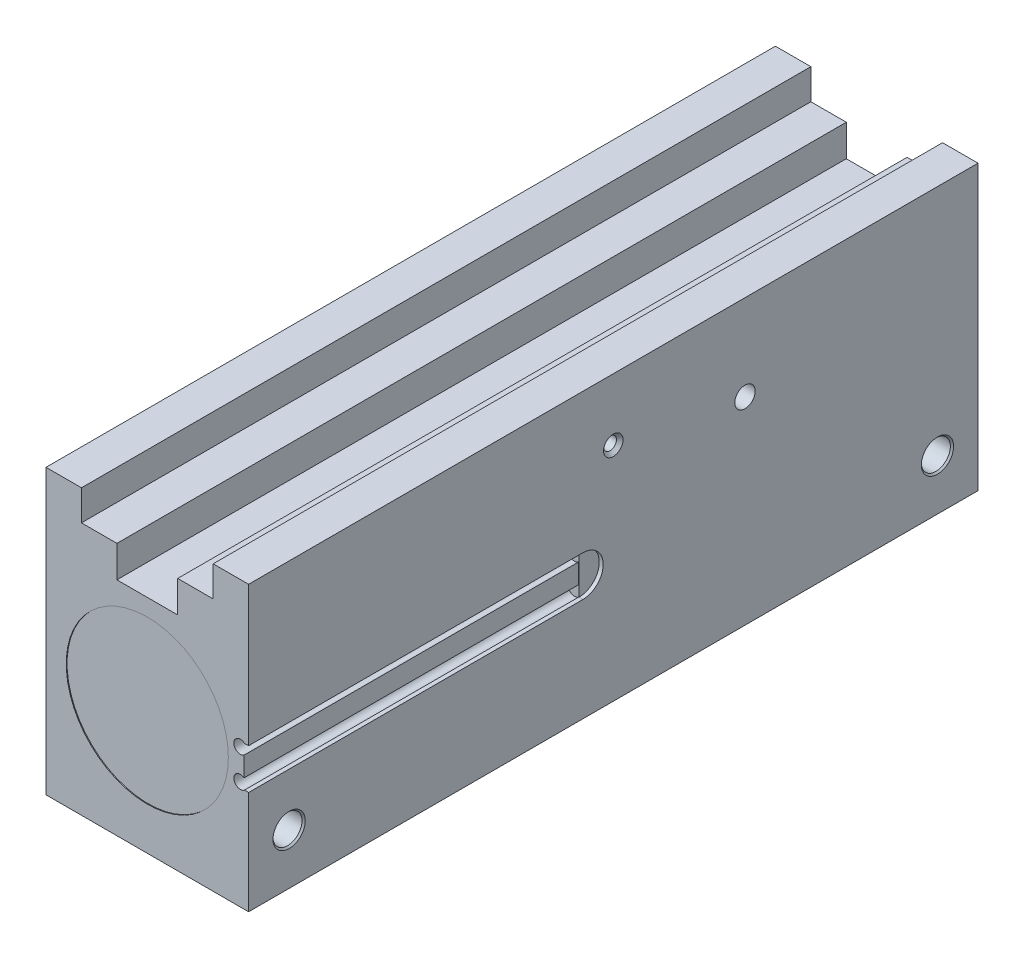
ISO-10303-21;
HEADER;
FILE_DESCRIPTION(('STEP AP214'),'2;1');
FILE_NAME('part.step','',(''),(''),'','','');
FILE_SCHEMA(('AUTOMOTIVE_DESIGN { 1 0 10303 214 1 1 1 1 }'));
ENDSEC;
DATA;
#1=APPLICATION_CONTEXT('core data for automotive mechanical design processes');
#2=APPLICATION_PROTOCOL_DEFINITION('international standard','automotive_design',2000,#1);
#3=PRODUCT_CONTEXT('',#1,'mechanical');
#4=PRODUCT('Part','Part','',(#3));
#5=PRODUCT_RELATED_PRODUCT_CATEGORY('part','',(#4));
#6=PRODUCT_DEFINITION_FORMATION('','',#4);
#7=PRODUCT_DEFINITION_CONTEXT('part definition',#1,'design');
#8=PRODUCT_DEFINITION('design','',#6,#7);
#9=PRODUCT_DEFINITION_SHAPE('','',#8);
#10=(LENGTH_UNIT() NAMED_UNIT(*) SI_UNIT(.MILLI.,.METRE.));
#11=(NAMED_UNIT(*) PLANE_ANGLE_UNIT() SI_UNIT($,.RADIAN.));
#12=(NAMED_UNIT(*) SI_UNIT($,.STERADIAN.) SOLID_ANGLE_UNIT());
#13=UNCERTAINTY_MEASURE_WITH_UNIT(LENGTH_MEASURE(1.E-05),#10,'distance_accuracy_value','');
#14=(GEOMETRIC_REPRESENTATION_CONTEXT(3) GLOBAL_UNCERTAINTY_ASSIGNED_CONTEXT((#13)) GLOBAL_UNIT_ASSIGNED_CONTEXT((#10,
#11,#12)) REPRESENTATION_CONTEXT('',''));
#15=CARTESIAN_POINT('',(0.,0.,0.));
#16=DIRECTION('',(0.,0.,1.));
#17=DIRECTION('',(1.,0.,0.));
#18=AXIS2_PLACEMENT_3D('',#15,#16,#17);
#19=CARTESIAN_POINT('',(60.9092,33.9725,-104.775));
#20=DIRECTION('',(0.,0.,1.));
#21=DIRECTION('',(1.,0.,0.));
#22=AXIS2_PLACEMENT_3D('',#19,#20,#21);
#23=PLANE('',#22);
#24=DIRECTION('',(1.,0.,0.));
#25=VECTOR('',#24,1.);
#26=CARTESIAN_POINT('',(62.1978589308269,32.385,-104.775));
#27=LINE('',#26,#25);
#28=CARTESIAN_POINT('',(62.1978589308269,32.385,-104.775));
#29=VERTEX_POINT('',#28);
#30=CARTESIAN_POINT('',(62.2681,32.385,-104.775));
#31=VERTEX_POINT('',#30);
#32=EDGE_CURVE('E266',#29,#31,#27,.T.);
#33=ORIENTED_EDGE('',*,*,#32,.T.);
#34=DIRECTION('',(0.,1.,0.));
#35=VECTOR('',#34,1.);
#36=CARTESIAN_POINT('',(62.2681,33.9725,-104.775));
#37=LINE('',#36,#35);
#38=CARTESIAN_POINT('',(62.2681,45.085,-104.775));
#39=VERTEX_POINT('',#38);
#40=EDGE_CURVE('E11',#31,#39,#37,.T.);
#41=ORIENTED_EDGE('',*,*,#40,.T.);
#42=DIRECTION('',(-1.,0.,0.));
#43=VECTOR('',#42,1.);
#44=CARTESIAN_POINT('',(62.1978589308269,45.085,-104.775));
#45=LINE('',#44,#43);
#46=CARTESIAN_POINT('',(62.1978589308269,45.085,-104.775));
#47=VERTEX_POINT('',#46);
#48=EDGE_CURVE('E269',#39,#47,#45,.T.);
#49=ORIENTED_EDGE('',*,*,#48,.T.);
#50=CARTESIAN_POINT('',(60.9092,43.4975,-104.775));
#51=DIRECTION('',(0.,0.,1.));
#52=DIRECTION('',(1.,0.,0.));
#53=AXIS2_PLACEMENT_3D('',#50,#51,#52);
#54=CIRCLE('',#53,2.0447);
#55=CARTESIAN_POINT('',(62.0776,41.8195132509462,-104.775));
#56=VERTEX_POINT('',#55);
#57=EDGE_CURVE('E272',#47,#56,#54,.T.);
#58=ORIENTED_EDGE('',*,*,#57,.T.);
#59=DIRECTION('',(0.,-1.,0.));
#60=VECTOR('',#59,1.);
#61=CARTESIAN_POINT('',(62.0776,41.8195132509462,-104.775));
#62=LINE('',#61,#60);
#63=CARTESIAN_POINT('',(62.0776,35.6504867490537,-104.775));
#64=VERTEX_POINT('',#63);
#65=EDGE_CURVE('E275',#56,#64,#62,.T.);
#66=ORIENTED_EDGE('',*,*,#65,.T.);
#67=CARTESIAN_POINT('',(60.9092,33.9725,-104.775));
#68=DIRECTION('',(0.,0.,1.));
#69=DIRECTION('',(1.,0.,0.));
#70=AXIS2_PLACEMENT_3D('',#67,#68,#69);
#71=CIRCLE('',#70,2.0447);
#72=EDGE_CURVE('E261',#64,#29,#71,.T.);
#73=ORIENTED_EDGE('',*,*,#72,.T.);
#74=EDGE_LOOP('',(#33,#41,#49,#58,#66,#73));
#75=FACE_BOUND('',#74,.T.);
#76=ADVANCED_FACE('F37',(#75),#23,.T.);
#77=CARTESIAN_POINT('',(0.,88.9,-228.6));
#78=DIRECTION('',(0.,1.,0.));
#79=DIRECTION('',(0.,0.,1.));
#80=AXIS2_PLACEMENT_3D('',#77,#78,#79);
#81=PLANE('',#80);
#82=DIRECTION('',(0.,0.,1.));
#83=VECTOR('',#82,1.);
#84=CARTESIAN_POINT('',(11.1125,88.9,-228.6));
#85=LINE('',#84,#83);
#86=CARTESIAN_POINT('',(11.1125,88.9,-228.6));
#87=VERTEX_POINT('',#86);
#88=CARTESIAN_POINT('',(11.1125,88.9,0.));
#89=VERTEX_POINT('',#88);
#90=EDGE_CURVE('E403',#87,#89,#85,.T.);
#91=ORIENTED_EDGE('',*,*,#90,.F.);
#92=DIRECTION('',(-1.,0.,0.));
#93=VECTOR('',#92,1.);
#94=CARTESIAN_POINT('',(0.,88.9,-228.6));
#95=LINE('',#94,#93);
#96=CARTESIAN_POINT('',(0.,88.9,-228.6));
#97=VERTEX_POINT('',#96);
#98=EDGE_CURVE('E431',#87,#97,#95,.T.);
#99=ORIENTED_EDGE('',*,*,#98,.T.);
#100=DIRECTION('',(0.,0.,1.));
#101=VECTOR('',#100,1.);
#102=CARTESIAN_POINT('',(0.,88.9,-228.6));
#103=LINE('',#102,#101);
#104=CARTESIAN_POINT('',(0.,88.9,0.));
#105=VERTEX_POINT('',#104);
#106=EDGE_CURVE('E45',#97,#105,#103,.T.);
#107=ORIENTED_EDGE('',*,*,#106,.T.);
#108=DIRECTION('',(-1.,0.,0.));
#109=VECTOR('',#108,1.);
#110=CARTESIAN_POINT('',(0.,88.9,0.));
#111=LINE('',#110,#109);
#112=EDGE_CURVE('E445',#89,#105,#111,.T.);
#113=ORIENTED_EDGE('',*,*,#112,.F.);
#114=EDGE_LOOP('',(#91,#99,#107,#113));
#115=FACE_BOUND('',#114,.T.);
#116=ADVANCED_FACE('F471',(#115),#81,.T.);
#117=CARTESIAN_POINT('',(0.,0.,-228.6));
#118=DIRECTION('',(-1.,0.,0.));
#119=DIRECTION('',(0.,0.,1.));
#120=AXIS2_PLACEMENT_3D('',#117,#118,#119);
#121=PLANE('',#120);
#122=DIRECTION('',(0.,-1.,0.));
#123=VECTOR('',#122,1.);
#124=CARTESIAN_POINT('',(0.,0.,0.));
#125=LINE('',#124,#123);
#126=CARTESIAN_POINT('',(0.,0.,0.));
#127=VERTEX_POINT('',#126);
#128=EDGE_CURVE('E405',#105,#127,#125,.T.);
#129=ORIENTED_EDGE('',*,*,#128,.F.);
#130=ORIENTED_EDGE('',*,*,#106,.F.);
#131=DIRECTION('',(0.,-1.,0.));
#132=VECTOR('',#131,1.);
#133=CARTESIAN_POINT('',(0.,0.,-228.6));
#134=LINE('',#133,#132);
#135=CARTESIAN_POINT('',(0.,0.,-228.6));
#136=VERTEX_POINT('',#135);
#137=EDGE_CURVE('E421',#97,#136,#134,.T.);
#138=ORIENTED_EDGE('',*,*,#137,.T.);
#139=DIRECTION('',(0.,0.,1.));
#140=VECTOR('',#139,1.);
#141=CARTESIAN_POINT('',(0.,0.,-228.6));
#142=LINE('',#141,#140);
#143=EDGE_CURVE('E435',#136,#127,#142,.T.);
#144=ORIENTED_EDGE('',*,*,#143,.T.);
#145=EDGE_LOOP('',(#129,#130,#138,#144));
#146=FACE_BOUND('',#145,.T.);
#147=ADVANCED_FACE('F39',(#146),#121,.T.);
#148=DIRECTION('',(0.,0.,1.));
#149=VECTOR('',#148,1.);
#150=CARTESIAN_POINT('',(52.3875,88.9,-228.6));
#151=LINE('',#150,#149);
#152=CARTESIAN_POINT('',(52.3875,88.9,-228.6));
#153=VERTEX_POINT('',#152);
#154=CARTESIAN_POINT('',(52.3875,88.9,0.));
#155=VERTEX_POINT('',#154);
#156=EDGE_CURVE('E406',#153,#155,#151,.T.);
#157=ORIENTED_EDGE('',*,*,#156,.T.);
#158=CARTESIAN_POINT('',(63.5,88.9,0.));
#159=VERTEX_POINT('',#158);
#160=EDGE_CURVE('E425',#159,#155,#111,.T.);
#161=ORIENTED_EDGE('',*,*,#160,.F.);
#162=DIRECTION('',(0.,0.,1.));
#163=VECTOR('',#162,1.);
#164=CARTESIAN_POINT('',(63.5,88.9,-228.6));
#165=LINE('',#164,#163);
#166=CARTESIAN_POINT('',(63.5,88.9,-228.6));
#167=VERTEX_POINT('',#166);
#168=EDGE_CURVE('E450',#167,#159,#165,.T.);
#169=ORIENTED_EDGE('',*,*,#168,.F.);
#170=EDGE_CURVE('E432',#167,#153,#95,.T.);
#171=ORIENTED_EDGE('',*,*,#170,.T.);
#172=EDGE_LOOP('',(#157,#161,#169,#171));
#173=FACE_BOUND('',#172,.T.);
#174=ADVANCED_FACE('F508',(#173),#81,.T.);
#175=CARTESIAN_POINT('',(63.5,0.,-228.6));
#176=DIRECTION('',(1.,0.,0.));
#177=DIRECTION('',(0.,0.,-1.));
#178=AXIS2_PLACEMENT_3D('',#175,#176,#177);
#179=PLANE('',#178);
#180=CARTESIAN_POINT('',(63.5,69.469,-114.3));
#181=DIRECTION('',(1.,0.,0.));
#182=DIRECTION('',(0.,0.,-1.));
#183=AXIS2_PLACEMENT_3D('',#180,#181,#182);
#184=CIRCLE('',#183,3.048);
#185=CARTESIAN_POINT('',(63.5,69.469,-117.348));
#186=VERTEX_POINT('',#185);
#187=EDGE_CURVE('E223',#186,#186,#184,.T.);
#188=ORIENTED_EDGE('',*,*,#187,.F.);
#189=EDGE_LOOP('',(#188));
#190=FACE_BOUND('',#189,.T.);
#191=CARTESIAN_POINT('',(63.5,61.976,-155.575));
#192=DIRECTION('',(1.,0.,0.));
#193=DIRECTION('',(0.,0.,-1.));
#194=AXIS2_PLACEMENT_3D('',#191,#192,#193);
#195=CIRCLE('',#194,3.19405000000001);
#196=CARTESIAN_POINT('',(63.5,61.976,-158.76905));
#197=VERTEX_POINT('',#196);
#198=EDGE_CURVE('E234',#197,#197,#195,.T.);
#199=ORIENTED_EDGE('',*,*,#198,.F.);
#200=EDGE_LOOP('',(#199));
#201=FACE_BOUND('',#200,.T.);
#202=CARTESIAN_POINT('',(63.5,15.875,-12.7));
#203=DIRECTION('',(1.,0.,0.));
#204=DIRECTION('',(0.,0.,-1.));
#205=AXIS2_PLACEMENT_3D('',#202,#203,#204);
#206=CIRCLE('',#205,5.0546);
#207=CARTESIAN_POINT('',(63.5,15.875,-17.7546));
#208=VERTEX_POINT('',#207);
#209=EDGE_CURVE('E238',#208,#208,#206,.T.);
#210=ORIENTED_EDGE('',*,*,#209,.F.);
#211=EDGE_LOOP('',(#210));
#212=FACE_BOUND('',#211,.T.);
#213=CARTESIAN_POINT('',(63.5,15.875,-215.9));
#214=DIRECTION('',(1.,0.,0.));
#215=DIRECTION('',(0.,0.,-1.));
#216=AXIS2_PLACEMENT_3D('',#213,#214,#215);
#217=CIRCLE('',#216,5.0546);
#218=CARTESIAN_POINT('',(63.5,15.875,-220.9546));
#219=VERTEX_POINT('',#218);
#220=EDGE_CURVE('E249',#219,#219,#217,.T.);
#221=ORIENTED_EDGE('',*,*,#220,.F.);
#222=EDGE_LOOP('',(#221));
#223=FACE_BOUND('',#222,.T.);
#224=CARTESIAN_POINT('',(63.5,38.735,-104.775));
#225=DIRECTION('',(1.,0.,0.));
#226=DIRECTION('',(0.,0.,-1.));
#227=AXIS2_PLACEMENT_3D('',#224,#225,#226);
#228=CIRCLE('',#227,6.35);
#229=CARTESIAN_POINT('',(63.5,32.385,-104.775));
#230=VERTEX_POINT('',#229);
#231=CARTESIAN_POINT('',(63.5,45.085,-104.775));
#232=VERTEX_POINT('',#231);
#233=EDGE_CURVE('E258',#230,#232,#228,.T.);
#234=ORIENTED_EDGE('',*,*,#233,.F.);
#235=DIRECTION('',(0.,0.,1.));
#236=VECTOR('',#235,1.);
#237=CARTESIAN_POINT('',(63.5,32.385,-104.775));
#238=LINE('',#237,#236);
#239=CARTESIAN_POINT('',(63.5,32.385,0.));
#240=VERTEX_POINT('',#239);
#241=EDGE_CURVE('E299',#230,#240,#238,.T.);
#242=ORIENTED_EDGE('',*,*,#241,.T.);
#243=DIRECTION('',(0.,1.,0.));
#244=VECTOR('',#243,1.);
#245=CARTESIAN_POINT('',(63.5,0.,0.));
#246=LINE('',#245,#244);
#247=CARTESIAN_POINT('',(63.5,0.,0.));
#248=VERTEX_POINT('',#247);
#249=EDGE_CURVE('E442',#248,#240,#246,.T.);
#250=ORIENTED_EDGE('',*,*,#249,.F.);
#251=DIRECTION('',(0.,0.,1.));
#252=VECTOR('',#251,1.);
#253=CARTESIAN_POINT('',(63.5,0.,-228.6));
#254=LINE('',#253,#252);
#255=CARTESIAN_POINT('',(63.5,0.,-228.6));
#256=VERTEX_POINT('',#255);
#257=EDGE_CURVE('E453',#256,#248,#254,.T.);
#258=ORIENTED_EDGE('',*,*,#257,.F.);
#259=DIRECTION('',(0.,1.,0.));
#260=VECTOR('',#259,1.);
#261=CARTESIAN_POINT('',(63.5,0.,-228.6));
#262=LINE('',#261,#260);
#263=EDGE_CURVE('E428',#256,#167,#262,.T.);
#264=ORIENTED_EDGE('',*,*,#263,.T.);
#265=ORIENTED_EDGE('',*,*,#168,.T.);
#266=CARTESIAN_POINT('',(63.5,45.085,0.));
#267=VERTEX_POINT('',#266);
#268=EDGE_CURVE('E441',#267,#159,#246,.T.);
#269=ORIENTED_EDGE('',*,*,#268,.F.);
#270=DIRECTION('',(0.,0.,1.));
#271=VECTOR('',#270,1.);
#272=CARTESIAN_POINT('',(63.5,45.085,-104.775));
#273=LINE('',#272,#271);
#274=EDGE_CURVE('E297',#232,#267,#273,.T.);
#275=ORIENTED_EDGE('',*,*,#274,.F.);
#276=EDGE_LOOP('',(#234,#242,#250,#258,#264,#265,#269,#275));
#277=FACE_BOUND('',#276,.T.);
#278=ADVANCED_FACE('F479',(#190,#201,#212,#223,#277),#179,.T.);
#279=CARTESIAN_POINT('',(0.,0.,-228.6));
#280=DIRECTION('',(0.,-1.,0.));
#281=DIRECTION('',(0.,0.,-1.));
#282=AXIS2_PLACEMENT_3D('',#279,#280,#281);
#283=PLANE('',#282);
#284=CARTESIAN_POINT('',(31.75,0.,-12.7));
#285=DIRECTION('',(0.,-1.,0.));
#286=DIRECTION('',(0.,0.,-1.));
#287=AXIS2_PLACEMENT_3D('',#284,#285,#286);
#288=CIRCLE('',#287,5.0546);
#289=CARTESIAN_POINT('',(31.75,0.,-17.7546));
#290=VERTEX_POINT('',#289);
#291=EDGE_CURVE('E210',#290,#290,#288,.T.);
#292=ORIENTED_EDGE('',*,*,#291,.F.);
#293=EDGE_LOOP('',(#292));
#294=FACE_BOUND('',#293,.T.);
#295=CARTESIAN_POINT('',(31.75,0.,-215.9));
#296=DIRECTION('',(0.,-1.,0.));
#297=DIRECTION('',(0.,0.,-1.));
#298=AXIS2_PLACEMENT_3D('',#295,#296,#297);
#299=CIRCLE('',#298,5.0546);
#300=CARTESIAN_POINT('',(31.75,0.,-220.9546));
#301=VERTEX_POINT('',#300);
#302=EDGE_CURVE('E203',#301,#301,#299,.T.);
#303=ORIENTED_EDGE('',*,*,#302,.F.);
#304=EDGE_LOOP('',(#303));
#305=FACE_BOUND('',#304,.T.);
#306=CARTESIAN_POINT('',(9.525,0.,-88.9));
#307=DIRECTION('',(0.,-1.,0.));
#308=DIRECTION('',(0.,0.,-1.));
#309=AXIS2_PLACEMENT_3D('',#306,#307,#308);
#310=CIRCLE('',#309,3.81);
#311=CARTESIAN_POINT('',(9.525,0.,-92.71));
#312=VERTEX_POINT('',#311);
#313=EDGE_CURVE('E292',#312,#312,#310,.T.);
#314=ORIENTED_EDGE('',*,*,#313,.F.);
#315=EDGE_LOOP('',(#314));
#316=FACE_BOUND('',#315,.T.);
#317=CARTESIAN_POINT('',(53.975,0.,-88.9));
#318=DIRECTION('',(0.,-1.,0.));
#319=DIRECTION('',(0.,0.,-1.));
#320=AXIS2_PLACEMENT_3D('',#317,#318,#319);
#321=CIRCLE('',#320,3.81);
#322=CARTESIAN_POINT('',(53.975,0.,-92.71));
#323=VERTEX_POINT('',#322);
#324=EDGE_CURVE('E311',#323,#323,#321,.T.);
#325=ORIENTED_EDGE('',*,*,#324,.F.);
#326=EDGE_LOOP('',(#325));
#327=FACE_BOUND('',#326,.T.);
#328=CARTESIAN_POINT('',(53.974972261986,0.,-139.7));
#329=DIRECTION('',(0.,-1.,0.));
#330=DIRECTION('',(0.,0.,-1.));
#331=AXIS2_PLACEMENT_3D('',#328,#329,#330);
#332=CIRCLE('',#331,3.81);
#333=CARTESIAN_POINT('',(53.974972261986,0.,-143.51));
#334=VERTEX_POINT('',#333);
#335=EDGE_CURVE('E320',#334,#334,#332,.T.);
#336=ORIENTED_EDGE('',*,*,#335,.F.);
#337=EDGE_LOOP('',(#336));
#338=FACE_BOUND('',#337,.T.);
#339=CARTESIAN_POINT('',(9.525,0.,-139.650342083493));
#340=DIRECTION('',(0.,-1.,0.));
#341=DIRECTION('',(0.,0.,-1.));
#342=AXIS2_PLACEMENT_3D('',#339,#340,#341);
#343=CIRCLE('',#342,3.81);
#344=CARTESIAN_POINT('',(9.525,0.,-143.460342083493));
#345=VERTEX_POINT('',#344);
#346=EDGE_CURVE('E329',#345,#345,#343,.T.);
#347=ORIENTED_EDGE('',*,*,#346,.F.);
#348=EDGE_LOOP('',(#347));
#349=FACE_BOUND('',#348,.T.);
#350=CARTESIAN_POINT('',(9.525,0.,-114.3));
#351=DIRECTION('',(0.,-1.,0.));
#352=DIRECTION('',(0.,0.,-1.));
#353=AXIS2_PLACEMENT_3D('',#350,#351,#352);
#354=CIRCLE('',#353,3.2004);
#355=CARTESIAN_POINT('',(9.525,0.,-117.5004));
#356=VERTEX_POINT('',#355);
#357=EDGE_CURVE('E343',#356,#356,#354,.T.);
#358=ORIENTED_EDGE('',*,*,#357,.F.);
#359=EDGE_LOOP('',(#358));
#360=FACE_BOUND('',#359,.T.);
#361=CARTESIAN_POINT('',(53.975,0.,-114.3));
#362=DIRECTION('',(0.,-1.,0.));
#363=DIRECTION('',(0.,0.,-1.));
#364=AXIS2_PLACEMENT_3D('',#361,#362,#363);
#365=CIRCLE('',#364,3.2004);
#366=CARTESIAN_POINT('',(53.975,0.,-117.5004));
#367=VERTEX_POINT('',#366);
#368=EDGE_CURVE('E349',#367,#367,#365,.T.);
#369=ORIENTED_EDGE('',*,*,#368,.F.);
#370=EDGE_LOOP('',(#369));
#371=FACE_BOUND('',#370,.T.);
#372=CARTESIAN_POINT('',(31.75,0.,-190.5));
#373=DIRECTION('',(0.,-1.,0.));
#374=DIRECTION('',(0.,0.,-1.));
#375=AXIS2_PLACEMENT_3D('',#372,#373,#374);
#376=CIRCLE('',#375,3.2004);
#377=CARTESIAN_POINT('',(31.75,0.,-193.7004));
#378=VERTEX_POINT('',#377);
#379=EDGE_CURVE('E338',#378,#378,#376,.T.);
#380=ORIENTED_EDGE('',*,*,#379,.F.);
#381=EDGE_LOOP('',(#380));
#382=FACE_BOUND('',#381,.T.);
#383=CARTESIAN_POINT('',(31.75,0.,-38.1));
#384=DIRECTION('',(0.,-1.,0.));
#385=DIRECTION('',(0.,0.,-1.));
#386=AXIS2_PLACEMENT_3D('',#383,#384,#385);
#387=CIRCLE('',#386,3.2004);
#388=CARTESIAN_POINT('',(31.75,0.,-41.3004));
#389=VERTEX_POINT('',#388);
#390=EDGE_CURVE('E342',#389,#389,#387,.T.);
#391=ORIENTED_EDGE('',*,*,#390,.F.);
#392=EDGE_LOOP('',(#391));
#393=FACE_BOUND('',#392,.T.);
#394=DIRECTION('',(1.,0.,0.));
#395=VECTOR('',#394,1.);
#396=CARTESIAN_POINT('',(0.,0.,0.));
#397=LINE('',#396,#395);
#398=EDGE_CURVE('E438',#127,#248,#397,.T.);
#399=ORIENTED_EDGE('',*,*,#398,.F.);
#400=ORIENTED_EDGE('',*,*,#143,.F.);
#401=DIRECTION('',(1.,0.,0.));
#402=VECTOR('',#401,1.);
#403=CARTESIAN_POINT('',(0.,0.,-228.6));
#404=LINE('',#403,#402);
#405=EDGE_CURVE('E424',#136,#256,#404,.T.);
#406=ORIENTED_EDGE('',*,*,#405,.T.);
#407=ORIENTED_EDGE('',*,*,#257,.T.);
#408=EDGE_LOOP('',(#399,#400,#406,#407));
#409=FACE_BOUND('',#408,.T.);
#410=ADVANCED_FACE('F461',(#294,#305,#316,#327,#338,#349,#360,#371,#382,#393,#409),#283,.T.);
#411=CARTESIAN_POINT('',(0.,0.,-228.6));
#412=DIRECTION('',(0.,0.,-1.));
#413=DIRECTION('',(-1.,0.,0.));
#414=AXIS2_PLACEMENT_3D('',#411,#412,#413);
#415=PLANE('',#414);
#416=DIRECTION('',(0.,-1.,0.));
#417=VECTOR('',#416,1.);
#418=CARTESIAN_POINT('',(11.1125,88.9,-228.6));
#419=LINE('',#418,#417);
#420=CARTESIAN_POINT('',(11.1125,79.375,-228.6));
#421=VERTEX_POINT('',#420);
#422=EDGE_CURVE('E363',#87,#421,#419,.T.);
#423=ORIENTED_EDGE('',*,*,#422,.T.);
#424=DIRECTION('',(1.,0.,0.));
#425=VECTOR('',#424,1.);
#426=CARTESIAN_POINT('',(11.1125,79.375,-228.6));
#427=LINE('',#426,#425);
#428=CARTESIAN_POINT('',(22.225,79.375,-228.6));
#429=VERTEX_POINT('',#428);
#430=EDGE_CURVE('E366',#421,#429,#427,.T.);
#431=ORIENTED_EDGE('',*,*,#430,.T.);
#432=DIRECTION('',(0.,-1.,0.));
#433=VECTOR('',#432,1.);
#434=CARTESIAN_POINT('',(22.225,79.375,-228.6));
#435=LINE('',#434,#433);
#436=CARTESIAN_POINT('',(22.225,69.469,-228.6));
#437=VERTEX_POINT('',#436);
#438=EDGE_CURVE('E370',#429,#437,#435,.T.);
#439=ORIENTED_EDGE('',*,*,#438,.T.);
#440=DIRECTION('',(1.,0.,0.));
#441=VECTOR('',#440,1.);
#442=CARTESIAN_POINT('',(22.225,69.469,-228.6));
#443=LINE('',#442,#441);
#444=CARTESIAN_POINT('',(41.275,69.469,-228.6));
#445=VERTEX_POINT('',#444);
#446=EDGE_CURVE('E373',#437,#445,#443,.T.);
#447=ORIENTED_EDGE('',*,*,#446,.T.);
#448=DIRECTION('',(0.,1.,0.));
#449=VECTOR('',#448,1.);
#450=CARTESIAN_POINT('',(41.275,79.375,-228.6));
#451=LINE('',#450,#449);
#452=CARTESIAN_POINT('',(41.275,79.375,-228.6));
#453=VERTEX_POINT('',#452);
#454=EDGE_CURVE('E376',#445,#453,#451,.T.);
#455=ORIENTED_EDGE('',*,*,#454,.T.);
#456=DIRECTION('',(1.,0.,0.));
#457=VECTOR('',#456,1.);
#458=CARTESIAN_POINT('',(41.275,79.375,-228.6));
#459=LINE('',#458,#457);
#460=CARTESIAN_POINT('',(52.3875,79.375,-228.6));
#461=VERTEX_POINT('',#460);
#462=EDGE_CURVE('E379',#453,#461,#459,.T.);
#463=ORIENTED_EDGE('',*,*,#462,.T.);
#464=DIRECTION('',(0.,1.,0.));
#465=VECTOR('',#464,1.);
#466=CARTESIAN_POINT('',(52.3875,88.9,-228.6));
#467=LINE('',#466,#465);
#468=EDGE_CURVE('E382',#461,#153,#467,.T.);
#469=ORIENTED_EDGE('',*,*,#468,.T.);
#470=ORIENTED_EDGE('',*,*,#170,.F.);
#471=ORIENTED_EDGE('',*,*,#263,.F.);
#472=ORIENTED_EDGE('',*,*,#405,.F.);
#473=ORIENTED_EDGE('',*,*,#137,.F.);
#474=ORIENTED_EDGE('',*,*,#98,.F.);
#475=EDGE_LOOP('',(#423,#431,#439,#447,#455,#463,#469,#470,#471,#472,#473,#474));
#476=FACE_BOUND('',#475,.T.);
#477=ADVANCED_FACE('F474',(#476),#415,.T.);
#478=CARTESIAN_POINT('',(0.,0.,0.));
#479=DIRECTION('',(0.,0.,-1.));
#480=DIRECTION('',(-1.,0.,0.));
#481=AXIS2_PLACEMENT_3D('',#478,#479,#480);
#482=PLANE('',#481);
#483=CARTESIAN_POINT('',(31.75,38.735,0.));
#484=DIRECTION('',(0.,0.,1.));
#485=DIRECTION('',(1.,0.,0.));
#486=AXIS2_PLACEMENT_3D('',#483,#484,#485);
#487=CIRCLE('',#486,25.4);
#488=CARTESIAN_POINT('',(57.15,38.735,0.));
#489=VERTEX_POINT('',#488);
#490=EDGE_CURVE('E219',#489,#489,#487,.T.);
#491=ORIENTED_EDGE('',*,*,#490,.F.);
#492=EDGE_LOOP('',(#491));
#493=FACE_BOUND('',#492,.T.);
#494=CARTESIAN_POINT('',(60.9092,43.4975,0.));
#495=DIRECTION('',(0.,0.,1.));
#496=DIRECTION('',(1.,0.,0.));
#497=AXIS2_PLACEMENT_3D('',#494,#495,#496);
#498=CIRCLE('',#497,2.0447);
#499=CARTESIAN_POINT('',(62.1978589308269,45.085,0.));
#500=VERTEX_POINT('',#499);
#501=CARTESIAN_POINT('',(62.0776,41.8195132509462,0.));
#502=VERTEX_POINT('',#501);
#503=EDGE_CURVE('E285',#500,#502,#498,.T.);
#504=ORIENTED_EDGE('',*,*,#503,.F.);
#505=DIRECTION('',(-1.,0.,0.));
#506=VECTOR('',#505,1.);
#507=CARTESIAN_POINT('',(62.1978589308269,45.085,0.));
#508=LINE('',#507,#506);
#509=EDGE_CURVE('E282',#267,#500,#508,.T.);
#510=ORIENTED_EDGE('',*,*,#509,.F.);
#511=ORIENTED_EDGE('',*,*,#268,.T.);
#512=ORIENTED_EDGE('',*,*,#160,.T.);
#513=DIRECTION('',(0.,1.,0.));
#514=VECTOR('',#513,1.);
#515=CARTESIAN_POINT('',(52.3875,88.9,0.));
#516=LINE('',#515,#514);
#517=CARTESIAN_POINT('',(52.3875,79.375,0.));
#518=VERTEX_POINT('',#517);
#519=EDGE_CURVE('E367',#518,#155,#516,.T.);
#520=ORIENTED_EDGE('',*,*,#519,.F.);
#521=DIRECTION('',(1.,0.,0.));
#522=VECTOR('',#521,1.);
#523=CARTESIAN_POINT('',(41.275,79.375,0.));
#524=LINE('',#523,#522);
#525=CARTESIAN_POINT('',(41.275,79.375,0.));
#526=VERTEX_POINT('',#525);
#527=EDGE_CURVE('E399',#526,#518,#524,.T.);
#528=ORIENTED_EDGE('',*,*,#527,.F.);
#529=DIRECTION('',(0.,1.,0.));
#530=VECTOR('',#529,1.);
#531=CARTESIAN_POINT('',(41.275,79.375,0.));
#532=LINE('',#531,#530);
#533=CARTESIAN_POINT('',(41.275,69.469,0.));
#534=VERTEX_POINT('',#533);
#535=EDGE_CURVE('E396',#534,#526,#532,.T.);
#536=ORIENTED_EDGE('',*,*,#535,.F.);
#537=DIRECTION('',(1.,0.,0.));
#538=VECTOR('',#537,1.);
#539=CARTESIAN_POINT('',(22.225,69.469,0.));
#540=LINE('',#539,#538);
#541=CARTESIAN_POINT('',(22.225,69.469,0.));
#542=VERTEX_POINT('',#541);
#543=EDGE_CURVE('E393',#542,#534,#540,.T.);
#544=ORIENTED_EDGE('',*,*,#543,.F.);
#545=DIRECTION('',(0.,-1.,0.));
#546=VECTOR('',#545,1.);
#547=CARTESIAN_POINT('',(22.225,79.375,0.));
#548=LINE('',#547,#546);
#549=CARTESIAN_POINT('',(22.225,79.375,0.));
#550=VERTEX_POINT('',#549);
#551=EDGE_CURVE('E390',#550,#542,#548,.T.);
#552=ORIENTED_EDGE('',*,*,#551,.F.);
#553=DIRECTION('',(1.,0.,0.));
#554=VECTOR('',#553,1.);
#555=CARTESIAN_POINT('',(11.1125,79.375,0.));
#556=LINE('',#555,#554);
#557=CARTESIAN_POINT('',(11.1125,79.375,0.));
#558=VERTEX_POINT('',#557);
#559=EDGE_CURVE('E387',#558,#550,#556,.T.);
#560=ORIENTED_EDGE('',*,*,#559,.F.);
#561=DIRECTION('',(0.,-1.,0.));
#562=VECTOR('',#561,1.);
#563=CARTESIAN_POINT('',(11.1125,88.9,0.));
#564=LINE('',#563,#562);
#565=EDGE_CURVE('E360',#89,#558,#564,.T.);
#566=ORIENTED_EDGE('',*,*,#565,.F.);
#567=ORIENTED_EDGE('',*,*,#112,.T.);
#568=ORIENTED_EDGE('',*,*,#128,.T.);
#569=ORIENTED_EDGE('',*,*,#398,.T.);
#570=ORIENTED_EDGE('',*,*,#249,.T.);
#571=DIRECTION('',(1.,0.,0.));
#572=VECTOR('',#571,1.);
#573=CARTESIAN_POINT('',(62.1978589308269,32.385,0.));
#574=LINE('',#573,#572);
#575=CARTESIAN_POINT('',(62.1978589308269,32.385,0.));
#576=VERTEX_POINT('',#575);
#577=EDGE_CURVE('E280',#576,#240,#574,.T.);
#578=ORIENTED_EDGE('',*,*,#577,.F.);
#579=CARTESIAN_POINT('',(60.9092,33.9725,0.));
#580=DIRECTION('',(0.,0.,1.));
#581=DIRECTION('',(1.,0.,0.));
#582=AXIS2_PLACEMENT_3D('',#579,#580,#581);
#583=CIRCLE('',#582,2.0447);
#584=CARTESIAN_POINT('',(62.0776,35.6504867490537,0.));
#585=VERTEX_POINT('',#584);
#586=EDGE_CURVE('E59',#585,#576,#583,.T.);
#587=ORIENTED_EDGE('',*,*,#586,.F.);
#588=DIRECTION('',(0.,-1.,0.));
#589=VECTOR('',#588,1.);
#590=CARTESIAN_POINT('',(62.0776,41.8195132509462,0.));
#591=LINE('',#590,#589);
#592=EDGE_CURVE('E265',#502,#585,#591,.T.);
#593=ORIENTED_EDGE('',*,*,#592,.F.);
#594=EDGE_LOOP('',(#504,#510,#511,#512,#520,#528,#536,#544,#552,#560,#566,#567,#568,#569,#570,
#578,#587,#593));
#595=FACE_BOUND('',#594,.T.);
#596=ADVANCED_FACE('F465',(#493,#595),#482,.F.);
#597=CARTESIAN_POINT('',(11.1125,88.9,-228.6));
#598=DIRECTION('',(-1.,0.,0.));
#599=DIRECTION('',(0.,0.,1.));
#600=AXIS2_PLACEMENT_3D('',#597,#598,#599);
#601=PLANE('',#600);
#602=ORIENTED_EDGE('',*,*,#565,.T.);
#603=DIRECTION('',(0.,0.,1.));
#604=VECTOR('',#603,1.);
#605=CARTESIAN_POINT('',(11.1125,79.375,-228.6));
#606=LINE('',#605,#604);
#607=EDGE_CURVE('E385',#421,#558,#606,.T.);
#608=ORIENTED_EDGE('',*,*,#607,.F.);
#609=ORIENTED_EDGE('',*,*,#422,.F.);
#610=ORIENTED_EDGE('',*,*,#90,.T.);
#611=EDGE_LOOP('',(#602,#608,#609,#610));
#612=FACE_BOUND('',#611,.T.);
#613=ADVANCED_FACE('F531',(#612),#601,.F.);
#614=CARTESIAN_POINT('',(52.3875,88.9,-228.6));
#615=DIRECTION('',(1.,0.,0.));
#616=DIRECTION('',(0.,0.,-1.));
#617=AXIS2_PLACEMENT_3D('',#614,#615,#616);
#618=PLANE('',#617);
#619=ORIENTED_EDGE('',*,*,#519,.T.);
#620=ORIENTED_EDGE('',*,*,#156,.F.);
#621=ORIENTED_EDGE('',*,*,#468,.F.);
#622=DIRECTION('',(0.,0.,1.));
#623=VECTOR('',#622,1.);
#624=CARTESIAN_POINT('',(52.3875,79.375,-228.6));
#625=LINE('',#624,#623);
#626=EDGE_CURVE('E409',#461,#518,#625,.T.);
#627=ORIENTED_EDGE('',*,*,#626,.T.);
#628=EDGE_LOOP('',(#619,#620,#621,#627));
#629=FACE_BOUND('',#628,.T.);
#630=ADVANCED_FACE('F511',(#629),#618,.F.);
#631=CARTESIAN_POINT('',(41.275,79.375,-228.6));
#632=DIRECTION('',(0.,-1.,0.));
#633=DIRECTION('',(0.,0.,-1.));
#634=AXIS2_PLACEMENT_3D('',#631,#632,#633);
#635=PLANE('',#634);
#636=ORIENTED_EDGE('',*,*,#527,.T.);
#637=ORIENTED_EDGE('',*,*,#626,.F.);
#638=ORIENTED_EDGE('',*,*,#462,.F.);
#639=DIRECTION('',(0.,0.,1.));
#640=VECTOR('',#639,1.);
#641=CARTESIAN_POINT('',(41.275,79.375,-228.6));
#642=LINE('',#641,#640);
#643=EDGE_CURVE('E411',#453,#526,#642,.T.);
#644=ORIENTED_EDGE('',*,*,#643,.T.);
#645=EDGE_LOOP('',(#636,#637,#638,#644));
#646=FACE_BOUND('',#645,.T.);
#647=ADVANCED_FACE('F515',(#646),#635,.F.);
#648=CARTESIAN_POINT('',(41.275,79.375,-228.6));
#649=DIRECTION('',(1.,0.,0.));
#650=DIRECTION('',(0.,0.,-1.));
#651=AXIS2_PLACEMENT_3D('',#648,#649,#650);
#652=PLANE('',#651);
#653=ORIENTED_EDGE('',*,*,#535,.T.);
#654=ORIENTED_EDGE('',*,*,#643,.F.);
#655=ORIENTED_EDGE('',*,*,#454,.F.);
#656=DIRECTION('',(0.,0.,1.));
#657=VECTOR('',#656,1.);
#658=CARTESIAN_POINT('',(41.275,69.469,-228.6));
#659=LINE('',#658,#657);
#660=EDGE_CURVE('E413',#445,#534,#659,.T.);
#661=ORIENTED_EDGE('',*,*,#660,.T.);
#662=EDGE_LOOP('',(#653,#654,#655,#661));
#663=FACE_BOUND('',#662,.T.);
#664=ADVANCED_FACE('F520',(#663),#652,.F.);
#665=CARTESIAN_POINT('',(22.225,69.469,-228.6));
#666=DIRECTION('',(0.,-1.,0.));
#667=DIRECTION('',(0.,0.,-1.));
#668=AXIS2_PLACEMENT_3D('',#665,#666,#667);
#669=PLANE('',#668);
#670=ORIENTED_EDGE('',*,*,#543,.T.);
#671=ORIENTED_EDGE('',*,*,#660,.F.);
#672=ORIENTED_EDGE('',*,*,#446,.F.);
#673=DIRECTION('',(0.,0.,1.));
#674=VECTOR('',#673,1.);
#675=CARTESIAN_POINT('',(22.225,69.469,-228.6));
#676=LINE('',#675,#674);
#677=EDGE_CURVE('E415',#437,#542,#676,.T.);
#678=ORIENTED_EDGE('',*,*,#677,.T.);
#679=EDGE_LOOP('',(#670,#671,#672,#678));
#680=FACE_BOUND('',#679,.T.);
#681=ADVANCED_FACE('F523',(#680),#669,.F.);
#682=CARTESIAN_POINT('',(22.225,79.375,-228.6));
#683=DIRECTION('',(-1.,0.,0.));
#684=DIRECTION('',(0.,0.,1.));
#685=AXIS2_PLACEMENT_3D('',#682,#683,#684);
#686=PLANE('',#685);
#687=ORIENTED_EDGE('',*,*,#551,.T.);
#688=ORIENTED_EDGE('',*,*,#677,.F.);
#689=ORIENTED_EDGE('',*,*,#438,.F.);
#690=DIRECTION('',(0.,0.,1.));
#691=VECTOR('',#690,1.);
#692=CARTESIAN_POINT('',(22.225,79.375,-228.6));
#693=LINE('',#692,#691);
#694=EDGE_CURVE('E417',#429,#550,#693,.T.);
#695=ORIENTED_EDGE('',*,*,#694,.T.);
#696=EDGE_LOOP('',(#687,#688,#689,#695));
#697=FACE_BOUND('',#696,.T.);
#698=ADVANCED_FACE('F526',(#697),#686,.F.);
#699=CARTESIAN_POINT('',(11.1125,79.375,-228.6));
#700=DIRECTION('',(0.,-1.,0.));
#701=DIRECTION('',(0.,0.,-1.));
#702=AXIS2_PLACEMENT_3D('',#699,#700,#701);
#703=PLANE('',#702);
#704=ORIENTED_EDGE('',*,*,#559,.T.);
#705=ORIENTED_EDGE('',*,*,#694,.F.);
#706=ORIENTED_EDGE('',*,*,#430,.F.);
#707=ORIENTED_EDGE('',*,*,#607,.T.);
#708=EDGE_LOOP('',(#704,#705,#706,#707));
#709=FACE_BOUND('',#708,.T.);
#710=ADVANCED_FACE('F528',(#709),#703,.F.);
#711=CARTESIAN_POINT('',(31.75,6.35,-38.1));
#712=DIRECTION('',(0.,-1.,0.));
#713=DIRECTION('',(0.,0.,-1.));
#714=AXIS2_PLACEMENT_3D('',#711,#712,#713);
#715=CYLINDRICAL_SURFACE('',#714,3.2004);
#716=CARTESIAN_POINT('',(31.75,6.35,-38.1));
#717=DIRECTION('',(0.,-1.,0.));
#718=DIRECTION('',(0.,0.,-1.));
#719=AXIS2_PLACEMENT_3D('',#716,#717,#718);
#720=CIRCLE('',#719,3.2004);
#721=CARTESIAN_POINT('',(31.75,6.35,-41.3004));
#722=VERTEX_POINT('',#721);
#723=EDGE_CURVE('E357',#722,#722,#720,.T.);
#724=ORIENTED_EDGE('',*,*,#723,.F.);
#725=EDGE_LOOP('',(#724));
#726=FACE_BOUND('',#725,.T.);
#727=ORIENTED_EDGE('',*,*,#390,.T.);
#728=EDGE_LOOP('',(#727));
#729=FACE_BOUND('',#728,.T.);
#730=ADVANCED_FACE('F638',(#726,#729),#715,.F.);
#731=CARTESIAN_POINT('',(31.75,6.35,-38.1));
#732=DIRECTION('',(0.,-1.,0.));
#733=DIRECTION('',(0.,0.,-1.));
#734=AXIS2_PLACEMENT_3D('',#731,#732,#733);
#735=PLANE('',#734);
#736=ORIENTED_EDGE('',*,*,#723,.T.);
#737=EDGE_LOOP('',(#736));
#738=FACE_BOUND('',#737,.T.);
#739=ADVANCED_FACE('F634',(#738),#735,.T.);
#740=CARTESIAN_POINT('',(31.75,6.35,-190.5));
#741=DIRECTION('',(0.,-1.,0.));
#742=DIRECTION('',(0.,0.,-1.));
#743=AXIS2_PLACEMENT_3D('',#740,#741,#742);
#744=CYLINDRICAL_SURFACE('',#743,3.2004);
#745=CARTESIAN_POINT('',(31.75,6.35,-190.5));
#746=DIRECTION('',(0.,-1.,0.));
#747=DIRECTION('',(0.,0.,-1.));
#748=AXIS2_PLACEMENT_3D('',#745,#746,#747);
#749=CIRCLE('',#748,3.2004);
#750=CARTESIAN_POINT('',(31.75,6.35,-193.7004));
#751=VERTEX_POINT('',#750);
#752=EDGE_CURVE('E352',#751,#751,#749,.T.);
#753=ORIENTED_EDGE('',*,*,#752,.F.);
#754=EDGE_LOOP('',(#753));
#755=FACE_BOUND('',#754,.T.);
#756=ORIENTED_EDGE('',*,*,#379,.T.);
#757=EDGE_LOOP('',(#756));
#758=FACE_BOUND('',#757,.T.);
#759=ADVANCED_FACE('F630',(#755,#758),#744,.F.);
#760=CARTESIAN_POINT('',(31.75,6.35,-190.5));
#761=DIRECTION('',(0.,-1.,0.));
#762=DIRECTION('',(0.,0.,-1.));
#763=AXIS2_PLACEMENT_3D('',#760,#761,#762);
#764=PLANE('',#763);
#765=ORIENTED_EDGE('',*,*,#752,.T.);
#766=EDGE_LOOP('',(#765));
#767=FACE_BOUND('',#766,.T.);
#768=ADVANCED_FACE('F626',(#767),#764,.T.);
#769=CARTESIAN_POINT('',(53.975,6.35,-114.3));
#770=DIRECTION('',(0.,-1.,0.));
#771=DIRECTION('',(0.,0.,-1.));
#772=AXIS2_PLACEMENT_3D('',#769,#770,#771);
#773=CYLINDRICAL_SURFACE('',#772,3.2004);
#774=CARTESIAN_POINT('',(53.975,6.35,-114.3));
#775=DIRECTION('',(0.,-1.,0.));
#776=DIRECTION('',(0.,0.,-1.));
#777=AXIS2_PLACEMENT_3D('',#774,#775,#776);
#778=CIRCLE('',#777,3.2004);
#779=CARTESIAN_POINT('',(53.975,6.35,-117.5004));
#780=VERTEX_POINT('',#779);
#781=EDGE_CURVE('E346',#780,#780,#778,.T.);
#782=ORIENTED_EDGE('',*,*,#781,.F.);
#783=EDGE_LOOP('',(#782));
#784=FACE_BOUND('',#783,.T.);
#785=ORIENTED_EDGE('',*,*,#368,.T.);
#786=EDGE_LOOP('',(#785));
#787=FACE_BOUND('',#786,.T.);
#788=ADVANCED_FACE('F622',(#784,#787),#773,.F.);
#789=CARTESIAN_POINT('',(53.975,6.35,-114.3));
#790=DIRECTION('',(0.,-1.,0.));
#791=DIRECTION('',(0.,0.,-1.));
#792=AXIS2_PLACEMENT_3D('',#789,#790,#791);
#793=PLANE('',#792);
#794=ORIENTED_EDGE('',*,*,#781,.T.);
#795=EDGE_LOOP('',(#794));
#796=FACE_BOUND('',#795,.T.);
#797=ADVANCED_FACE('F618',(#796),#793,.T.);
#798=CARTESIAN_POINT('',(9.525,6.35,-114.3));
#799=DIRECTION('',(0.,-1.,0.));
#800=DIRECTION('',(0.,0.,-1.));
#801=AXIS2_PLACEMENT_3D('',#798,#799,#800);
#802=CYLINDRICAL_SURFACE('',#801,3.2004);
#803=CARTESIAN_POINT('',(9.525,6.35,-114.3));
#804=DIRECTION('',(0.,-1.,0.));
#805=DIRECTION('',(0.,0.,-1.));
#806=AXIS2_PLACEMENT_3D('',#803,#804,#805);
#807=CIRCLE('',#806,3.2004);
#808=CARTESIAN_POINT('',(9.525,6.35,-117.5004));
#809=VERTEX_POINT('',#808);
#810=EDGE_CURVE('E339',#809,#809,#807,.T.);
#811=ORIENTED_EDGE('',*,*,#810,.F.);
#812=EDGE_LOOP('',(#811));
#813=FACE_BOUND('',#812,.T.);
#814=ORIENTED_EDGE('',*,*,#357,.T.);
#815=EDGE_LOOP('',(#814));
#816=FACE_BOUND('',#815,.T.);
#817=ADVANCED_FACE('F614',(#813,#816),#802,.F.);
#818=CARTESIAN_POINT('',(9.525,6.35,-114.3));
#819=DIRECTION('',(0.,-1.,0.));
#820=DIRECTION('',(0.,0.,-1.));
#821=AXIS2_PLACEMENT_3D('',#818,#819,#820);
#822=PLANE('',#821);
#823=ORIENTED_EDGE('',*,*,#810,.T.);
#824=EDGE_LOOP('',(#823));
#825=FACE_BOUND('',#824,.T.);
#826=ADVANCED_FACE('F610',(#825),#822,.T.);
#827=CARTESIAN_POINT('',(9.525,11.43,-139.650342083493));
#828=DIRECTION('',(0.,-1.,0.));
#829=DIRECTION('',(0.,0.,-1.));
#830=AXIS2_PLACEMENT_3D('',#827,#828,#829);
#831=CONICAL_SURFACE('',#830,2.5527,1.02974425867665);
#832=CARTESIAN_POINT('',(9.525,12.9638169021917,-139.650342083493));
#833=VERTEX_POINT('',#832);
#834=VERTEX_LOOP('',#833);
#835=FACE_BOUND('',#834,.T.);
#836=CARTESIAN_POINT('',(9.525,11.43,-139.650342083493));
#837=DIRECTION('',(0.,-1.,0.));
#838=DIRECTION('',(0.,0.,-1.));
#839=AXIS2_PLACEMENT_3D('',#836,#837,#838);
#840=CIRCLE('',#839,2.5527);
#841=CARTESIAN_POINT('',(9.525,11.43,-142.203042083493));
#842=VERTEX_POINT('',#841);
#843=EDGE_CURVE('E335',#842,#842,#840,.T.);
#844=ORIENTED_EDGE('',*,*,#843,.T.);
#845=EDGE_LOOP('',(#844));
#846=FACE_BOUND('',#845,.T.);
#847=ADVANCED_FACE('F606',(#835,#846),#831,.F.);
#848=CARTESIAN_POINT('',(9.525,0.,-139.650342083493));
#849=DIRECTION('',(0.,-1.,0.));
#850=DIRECTION('',(0.,0.,-1.));
#851=AXIS2_PLACEMENT_3D('',#848,#849,#850);
#852=CYLINDRICAL_SURFACE('',#851,2.5527);
#853=ORIENTED_EDGE('',*,*,#843,.F.);
#854=EDGE_LOOP('',(#853));
#855=FACE_BOUND('',#854,.T.);
#856=CARTESIAN_POINT('',(9.525,1.2573,-139.650342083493));
#857=DIRECTION('',(0.,-1.,0.));
#858=DIRECTION('',(0.,0.,-1.));
#859=AXIS2_PLACEMENT_3D('',#856,#857,#858);
#860=CIRCLE('',#859,2.5527);
#861=CARTESIAN_POINT('',(9.525,1.2573,-142.203042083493));
#862=VERTEX_POINT('',#861);
#863=EDGE_CURVE('E332',#862,#862,#860,.T.);
#864=ORIENTED_EDGE('',*,*,#863,.T.);
#865=EDGE_LOOP('',(#864));
#866=FACE_BOUND('',#865,.T.);
#867=ADVANCED_FACE('F602',(#855,#866),#852,.F.);
#868=CARTESIAN_POINT('',(9.525,0.,-139.650342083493));
#869=DIRECTION('',(0.,-1.,0.));
#870=DIRECTION('',(0.,0.,-1.));
#871=AXIS2_PLACEMENT_3D('',#868,#869,#870);
#872=CONICAL_SURFACE('',#871,3.81,0.785398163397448);
#873=ORIENTED_EDGE('',*,*,#863,.F.);
#874=EDGE_LOOP('',(#873));
#875=FACE_BOUND('',#874,.T.);
#876=ORIENTED_EDGE('',*,*,#346,.T.);
#877=EDGE_LOOP('',(#876));
#878=FACE_BOUND('',#877,.T.);
#879=ADVANCED_FACE('F598',(#875,#878),#872,.F.);
#880=CARTESIAN_POINT('',(53.974972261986,11.43,-139.7));
#881=DIRECTION('',(0.,-1.,0.));
#882=DIRECTION('',(0.,0.,-1.));
#883=AXIS2_PLACEMENT_3D('',#880,#881,#882);
#884=CONICAL_SURFACE('',#883,2.5527,1.02974425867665);
#885=CARTESIAN_POINT('',(53.974972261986,12.9638169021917,-139.7));
#886=VERTEX_POINT('',#885);
#887=VERTEX_LOOP('',#886);
#888=FACE_BOUND('',#887,.T.);
#889=CARTESIAN_POINT('',(53.974972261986,11.43,-139.7));
#890=DIRECTION('',(0.,-1.,0.));
#891=DIRECTION('',(0.,0.,-1.));
#892=AXIS2_PLACEMENT_3D('',#889,#890,#891);
#893=CIRCLE('',#892,2.5527);
#894=CARTESIAN_POINT('',(53.974972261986,11.43,-142.2527));
#895=VERTEX_POINT('',#894);
#896=EDGE_CURVE('E326',#895,#895,#893,.T.);
#897=ORIENTED_EDGE('',*,*,#896,.T.);
#898=EDGE_LOOP('',(#897));
#899=FACE_BOUND('',#898,.T.);
#900=ADVANCED_FACE('F594',(#888,#899),#884,.F.);
#901=CARTESIAN_POINT('',(53.974972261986,0.,-139.7));
#902=DIRECTION('',(0.,-1.,0.));
#903=DIRECTION('',(0.,0.,-1.));
#904=AXIS2_PLACEMENT_3D('',#901,#902,#903);
#905=CYLINDRICAL_SURFACE('',#904,2.5527);
#906=ORIENTED_EDGE('',*,*,#896,.F.);
#907=EDGE_LOOP('',(#906));
#908=FACE_BOUND('',#907,.T.);
#909=CARTESIAN_POINT('',(53.974972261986,1.2573,-139.7));
#910=DIRECTION('',(0.,-1.,0.));
#911=DIRECTION('',(0.,0.,-1.));
#912=AXIS2_PLACEMENT_3D('',#909,#910,#911);
#913=CIRCLE('',#912,2.5527);
#914=CARTESIAN_POINT('',(53.974972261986,1.2573,-142.2527));
#915=VERTEX_POINT('',#914);
#916=EDGE_CURVE('E323',#915,#915,#913,.T.);
#917=ORIENTED_EDGE('',*,*,#916,.T.);
#918=EDGE_LOOP('',(#917));
#919=FACE_BOUND('',#918,.T.);
#920=ADVANCED_FACE('F590',(#908,#919),#905,.F.);
#921=CARTESIAN_POINT('',(53.974972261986,0.,-139.7));
#922=DIRECTION('',(0.,-1.,0.));
#923=DIRECTION('',(0.,0.,-1.));
#924=AXIS2_PLACEMENT_3D('',#921,#922,#923);
#925=CONICAL_SURFACE('',#924,3.81,0.785398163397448);
#926=ORIENTED_EDGE('',*,*,#916,.F.);
#927=EDGE_LOOP('',(#926));
#928=FACE_BOUND('',#927,.T.);
#929=ORIENTED_EDGE('',*,*,#335,.T.);
#930=EDGE_LOOP('',(#929));
#931=FACE_BOUND('',#930,.T.);
#932=ADVANCED_FACE('F586',(#928,#931),#925,.F.);
#933=CARTESIAN_POINT('',(53.975,11.43,-88.9));
#934=DIRECTION('',(0.,-1.,0.));
#935=DIRECTION('',(0.,0.,-1.));
#936=AXIS2_PLACEMENT_3D('',#933,#934,#935);
#937=CONICAL_SURFACE('',#936,2.5527,1.02974425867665);
#938=CARTESIAN_POINT('',(53.975,12.9638169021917,-88.9));
#939=VERTEX_POINT('',#938);
#940=VERTEX_LOOP('',#939);
#941=FACE_BOUND('',#940,.T.);
#942=CARTESIAN_POINT('',(53.975,11.43,-88.9));
#943=DIRECTION('',(0.,-1.,0.));
#944=DIRECTION('',(0.,0.,-1.));
#945=AXIS2_PLACEMENT_3D('',#942,#943,#944);
#946=CIRCLE('',#945,2.5527);
#947=CARTESIAN_POINT('',(53.975,11.43,-91.4527));
#948=VERTEX_POINT('',#947);
#949=EDGE_CURVE('E317',#948,#948,#946,.T.);
#950=ORIENTED_EDGE('',*,*,#949,.T.);
#951=EDGE_LOOP('',(#950));
#952=FACE_BOUND('',#951,.T.);
#953=ADVANCED_FACE('F582',(#941,#952),#937,.F.);
#954=CARTESIAN_POINT('',(53.975,0.,-88.9));
#955=DIRECTION('',(0.,-1.,0.));
#956=DIRECTION('',(0.,0.,-1.));
#957=AXIS2_PLACEMENT_3D('',#954,#955,#956);
#958=CYLINDRICAL_SURFACE('',#957,2.5527);
#959=ORIENTED_EDGE('',*,*,#949,.F.);
#960=EDGE_LOOP('',(#959));
#961=FACE_BOUND('',#960,.T.);
#962=CARTESIAN_POINT('',(53.975,1.2573,-88.9));
#963=DIRECTION('',(0.,-1.,0.));
#964=DIRECTION('',(0.,0.,-1.));
#965=AXIS2_PLACEMENT_3D('',#962,#963,#964);
#966=CIRCLE('',#965,2.5527);
#967=CARTESIAN_POINT('',(53.975,1.2573,-91.4527));
#968=VERTEX_POINT('',#967);
#969=EDGE_CURVE('E314',#968,#968,#966,.T.);
#970=ORIENTED_EDGE('',*,*,#969,.T.);
#971=EDGE_LOOP('',(#970));
#972=FACE_BOUND('',#971,.T.);
#973=ADVANCED_FACE('F578',(#961,#972),#958,.F.);
#974=CARTESIAN_POINT('',(53.975,0.,-88.9));
#975=DIRECTION('',(0.,-1.,0.));
#976=DIRECTION('',(0.,0.,-1.));
#977=AXIS2_PLACEMENT_3D('',#974,#975,#976);
#978=CONICAL_SURFACE('',#977,3.81,0.785398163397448);
#979=ORIENTED_EDGE('',*,*,#969,.F.);
#980=EDGE_LOOP('',(#979));
#981=FACE_BOUND('',#980,.T.);
#982=ORIENTED_EDGE('',*,*,#324,.T.);
#983=EDGE_LOOP('',(#982));
#984=FACE_BOUND('',#983,.T.);
#985=ADVANCED_FACE('F574',(#981,#984),#978,.F.);
#986=CARTESIAN_POINT('',(9.525,11.43,-88.9));
#987=DIRECTION('',(0.,-1.,0.));
#988=DIRECTION('',(0.,0.,-1.));
#989=AXIS2_PLACEMENT_3D('',#986,#987,#988);
#990=CONICAL_SURFACE('',#989,2.5527,1.02974425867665);
#991=CARTESIAN_POINT('',(9.525,12.9638169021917,-88.9));
#992=VERTEX_POINT('',#991);
#993=VERTEX_LOOP('',#992);
#994=FACE_BOUND('',#993,.T.);
#995=CARTESIAN_POINT('',(9.525,11.43,-88.9));
#996=DIRECTION('',(0.,-1.,0.));
#997=DIRECTION('',(0.,0.,-1.));
#998=AXIS2_PLACEMENT_3D('',#995,#996,#997);
#999=CIRCLE('',#998,2.5527);
#1000=CARTESIAN_POINT('',(9.525,11.43,-91.4527));
#1001=VERTEX_POINT('',#1000);
#1002=EDGE_CURVE('E308',#1001,#1001,#999,.T.);
#1003=ORIENTED_EDGE('',*,*,#1002,.T.);
#1004=EDGE_LOOP('',(#1003));
#1005=FACE_BOUND('',#1004,.T.);
#1006=ADVANCED_FACE('F570',(#994,#1005),#990,.F.);
#1007=CARTESIAN_POINT('',(9.525,0.,-88.9));
#1008=DIRECTION('',(0.,-1.,0.));
#1009=DIRECTION('',(0.,0.,-1.));
#1010=AXIS2_PLACEMENT_3D('',#1007,#1008,#1009);
#1011=CYLINDRICAL_SURFACE('',#1010,2.5527);
#1012=ORIENTED_EDGE('',*,*,#1002,.F.);
#1013=EDGE_LOOP('',(#1012));
#1014=FACE_BOUND('',#1013,.T.);
#1015=CARTESIAN_POINT('',(9.525,1.2573,-88.9));
#1016=DIRECTION('',(0.,-1.,0.));
#1017=DIRECTION('',(0.,0.,-1.));
#1018=AXIS2_PLACEMENT_3D('',#1015,#1016,#1017);
#1019=CIRCLE('',#1018,2.5527);
#1020=CARTESIAN_POINT('',(9.525,1.2573,-91.4527));
#1021=VERTEX_POINT('',#1020);
#1022=EDGE_CURVE('E305',#1021,#1021,#1019,.T.);
#1023=ORIENTED_EDGE('',*,*,#1022,.T.);
#1024=EDGE_LOOP('',(#1023));
#1025=FACE_BOUND('',#1024,.T.);
#1026=ADVANCED_FACE('F566',(#1014,#1025),#1011,.F.);
#1027=CARTESIAN_POINT('',(9.525,0.,-88.9));
#1028=DIRECTION('',(0.,-1.,0.));
#1029=DIRECTION('',(0.,0.,-1.));
#1030=AXIS2_PLACEMENT_3D('',#1027,#1028,#1029);
#1031=CONICAL_SURFACE('',#1030,3.81,0.785398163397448);
#1032=ORIENTED_EDGE('',*,*,#1022,.F.);
#1033=EDGE_LOOP('',(#1032));
#1034=FACE_BOUND('',#1033,.T.);
#1035=ORIENTED_EDGE('',*,*,#313,.T.);
#1036=EDGE_LOOP('',(#1035));
#1037=FACE_BOUND('',#1036,.T.);
#1038=ADVANCED_FACE('F563',(#1034,#1037),#1031,.F.);
#1039=CARTESIAN_POINT('',(60.9092,33.9725,-104.775));
#1040=DIRECTION('',(0.,0.,1.));
#1041=DIRECTION('',(1.,0.,0.));
#1042=AXIS2_PLACEMENT_3D('',#1039,#1040,#1041);
#1043=CYLINDRICAL_SURFACE('',#1042,2.0447);
#1044=ORIENTED_EDGE('',*,*,#586,.T.);
#1045=DIRECTION('',(0.,0.,1.));
#1046=VECTOR('',#1045,1.);
#1047=CARTESIAN_POINT('',(62.1978589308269,32.385,-104.775));
#1048=LINE('',#1047,#1046);
#1049=EDGE_CURVE('E278',#29,#576,#1048,.T.);
#1050=ORIENTED_EDGE('',*,*,#1049,.F.);
#1051=ORIENTED_EDGE('',*,*,#72,.F.);
#1052=DIRECTION('',(0.,0.,1.));
#1053=VECTOR('',#1052,1.);
#1054=CARTESIAN_POINT('',(62.0776,35.6504867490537,-104.775));
#1055=LINE('',#1054,#1053);
#1056=EDGE_CURVE('E290',#64,#585,#1055,.T.);
#1057=ORIENTED_EDGE('',*,*,#1056,.T.);
#1058=EDGE_LOOP('',(#1044,#1050,#1051,#1057));
#1059=FACE_BOUND('',#1058,.T.);
#1060=ADVANCED_FACE('F490',(#1059),#1043,.F.);
#1061=CARTESIAN_POINT('',(62.0776,41.8195132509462,-104.775));
#1062=DIRECTION('',(-1.,0.,0.));
#1063=DIRECTION('',(0.,-1.,0.));
#1064=AXIS2_PLACEMENT_3D('',#1061,#1062,#1063);
#1065=PLANE('',#1064);
#1066=ORIENTED_EDGE('',*,*,#592,.T.);
#1067=ORIENTED_EDGE('',*,*,#1056,.F.);
#1068=ORIENTED_EDGE('',*,*,#65,.F.);
#1069=DIRECTION('',(0.,0.,1.));
#1070=VECTOR('',#1069,1.);
#1071=CARTESIAN_POINT('',(62.0776,41.8195132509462,-104.775));
#1072=LINE('',#1071,#1070);
#1073=EDGE_CURVE('E293',#56,#502,#1072,.T.);
#1074=ORIENTED_EDGE('',*,*,#1073,.T.);
#1075=EDGE_LOOP('',(#1066,#1067,#1068,#1074));
#1076=FACE_BOUND('',#1075,.T.);
#1077=ADVANCED_FACE('F495',(#1076),#1065,.F.);
#1078=CARTESIAN_POINT('',(60.9092,43.4975,-104.775));
#1079=DIRECTION('',(0.,0.,1.));
#1080=DIRECTION('',(1.,0.,0.));
#1081=AXIS2_PLACEMENT_3D('',#1078,#1079,#1080);
#1082=CYLINDRICAL_SURFACE('',#1081,2.0447);
#1083=ORIENTED_EDGE('',*,*,#503,.T.);
#1084=ORIENTED_EDGE('',*,*,#1073,.F.);
#1085=ORIENTED_EDGE('',*,*,#57,.F.);
#1086=DIRECTION('',(0.,0.,1.));
#1087=VECTOR('',#1086,1.);
#1088=CARTESIAN_POINT('',(62.1978589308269,45.085,-104.775));
#1089=LINE('',#1088,#1087);
#1090=EDGE_CURVE('E295',#47,#500,#1089,.T.);
#1091=ORIENTED_EDGE('',*,*,#1090,.T.);
#1092=EDGE_LOOP('',(#1083,#1084,#1085,#1091));
#1093=FACE_BOUND('',#1092,.T.);
#1094=ADVANCED_FACE('F498',(#1093),#1082,.F.);
#1095=CARTESIAN_POINT('',(62.1978589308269,45.085,-104.775));
#1096=DIRECTION('',(0.,1.,0.));
#1097=DIRECTION('',(0.,0.,1.));
#1098=AXIS2_PLACEMENT_3D('',#1095,#1096,#1097);
#1099=PLANE('',#1098);
#1100=ORIENTED_EDGE('',*,*,#509,.T.);
#1101=ORIENTED_EDGE('',*,*,#1090,.F.);
#1102=ORIENTED_EDGE('',*,*,#48,.F.);
#1103=EDGE_CURVE('E270',#232,#39,#45,.T.);
#1104=ORIENTED_EDGE('',*,*,#1103,.F.);
#1105=ORIENTED_EDGE('',*,*,#274,.T.);
#1106=EDGE_LOOP('',(#1100,#1101,#1102,#1104,#1105));
#1107=FACE_BOUND('',#1106,.T.);
#1108=ADVANCED_FACE('F502',(#1107),#1099,.F.);
#1109=CARTESIAN_POINT('',(62.1978589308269,32.385,-104.775));
#1110=DIRECTION('',(0.,-1.,0.));
#1111=DIRECTION('',(1.,0.,0.));
#1112=AXIS2_PLACEMENT_3D('',#1109,#1110,#1111);
#1113=PLANE('',#1112);
#1114=ORIENTED_EDGE('',*,*,#577,.T.);
#1115=ORIENTED_EDGE('',*,*,#241,.F.);
#1116=EDGE_CURVE('E264',#31,#230,#27,.T.);
#1117=ORIENTED_EDGE('',*,*,#1116,.F.);
#1118=ORIENTED_EDGE('',*,*,#32,.F.);
#1119=ORIENTED_EDGE('',*,*,#1049,.T.);
#1120=EDGE_LOOP('',(#1114,#1115,#1117,#1118,#1119));
#1121=FACE_BOUND('',#1120,.T.);
#1122=ADVANCED_FACE('F486',(#1121),#1113,.F.);
#1123=CARTESIAN_POINT('',(62.2681,38.735,-104.775));
#1124=DIRECTION('',(1.,0.,0.));
#1125=DIRECTION('',(0.,0.,-1.));
#1126=AXIS2_PLACEMENT_3D('',#1123,#1124,#1125);
#1127=CYLINDRICAL_SURFACE('',#1126,6.35);
#1128=ORIENTED_EDGE('',*,*,#1116,.T.);
#1129=ORIENTED_EDGE('',*,*,#233,.T.);
#1130=ORIENTED_EDGE('',*,*,#1103,.T.);
#1131=CARTESIAN_POINT('',(62.2681,38.735,-104.775));
#1132=DIRECTION('',(1.,0.,0.));
#1133=DIRECTION('',(0.,0.,-1.));
#1134=AXIS2_PLACEMENT_3D('',#1131,#1132,#1133);
#1135=CIRCLE('',#1134,6.35);
#1136=EDGE_CURVE('E51',#31,#39,#1135,.T.);
#1137=ORIENTED_EDGE('',*,*,#1136,.F.);
#1138=EDGE_LOOP('',(#1128,#1129,#1130,#1137));
#1139=FACE_BOUND('',#1138,.T.);
#1140=ADVANCED_FACE('F551',(#1139),#1127,.F.);
#1141=CARTESIAN_POINT('',(62.2681,38.735,-104.775));
#1142=DIRECTION('',(1.,0.,0.));
#1143=DIRECTION('',(0.,0.,-1.));
#1144=AXIS2_PLACEMENT_3D('',#1141,#1142,#1143);
#1145=PLANE('',#1144);
#1146=ORIENTED_EDGE('',*,*,#1136,.T.);
#1147=ORIENTED_EDGE('',*,*,#40,.F.);
#1148=EDGE_LOOP('',(#1146,#1147));
#1149=FACE_BOUND('',#1148,.T.);
#1150=ADVANCED_FACE('F766',(#1149),#1145,.T.);
#1151=CARTESIAN_POINT('',(40.64,15.875,-215.9));
#1152=DIRECTION('',(1.,0.,0.));
#1153=DIRECTION('',(0.,0.,-1.));
#1154=AXIS2_PLACEMENT_3D('',#1151,#1152,#1153);
#1155=CONICAL_SURFACE('',#1154,4.54659999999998,1.02974425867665);
#1156=CARTESIAN_POINT('',(37.9081271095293,15.875,-215.9));
#1157=VERTEX_POINT('',#1156);
#1158=VERTEX_LOOP('',#1157);
#1159=FACE_BOUND('',#1158,.T.);
#1160=CARTESIAN_POINT('',(40.64,15.875,-215.9));
#1161=DIRECTION('',(1.,0.,0.));
#1162=DIRECTION('',(0.,0.,-1.));
#1163=AXIS2_PLACEMENT_3D('',#1160,#1161,#1162);
#1164=CIRCLE('',#1163,4.54659999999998);
#1165=CARTESIAN_POINT('',(40.64,15.875,-220.4466));
#1166=VERTEX_POINT('',#1165);
#1167=EDGE_CURVE('E255',#1166,#1166,#1164,.T.);
#1168=ORIENTED_EDGE('',*,*,#1167,.T.);
#1169=EDGE_LOOP('',(#1168));
#1170=FACE_BOUND('',#1169,.T.);
#1171=ADVANCED_FACE('F773',(#1159,#1170),#1155,.F.);
#1172=CARTESIAN_POINT('',(63.5,15.875,-215.9));
#1173=DIRECTION('',(1.,0.,0.));
#1174=DIRECTION('',(0.,0.,-1.));
#1175=AXIS2_PLACEMENT_3D('',#1172,#1173,#1174);
#1176=CYLINDRICAL_SURFACE('',#1175,4.54659999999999);
#1177=ORIENTED_EDGE('',*,*,#1167,.F.);
#1178=EDGE_LOOP('',(#1177));
#1179=FACE_BOUND('',#1178,.T.);
#1180=CARTESIAN_POINT('',(62.992,15.875,-215.9));
#1181=DIRECTION('',(1.,0.,0.));
#1182=DIRECTION('',(0.,0.,-1.));
#1183=AXIS2_PLACEMENT_3D('',#1180,#1181,#1182);
#1184=CIRCLE('',#1183,4.54659999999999);
#1185=CARTESIAN_POINT('',(62.992,15.875,-220.4466));
#1186=VERTEX_POINT('',#1185);
#1187=EDGE_CURVE('E252',#1186,#1186,#1184,.T.);
#1188=ORIENTED_EDGE('',*,*,#1187,.T.);
#1189=EDGE_LOOP('',(#1188));
#1190=FACE_BOUND('',#1189,.T.);
#1191=ADVANCED_FACE('F779',(#1179,#1190),#1176,.F.);
#1192=CARTESIAN_POINT('',(63.5,15.875,-215.9));
#1193=DIRECTION('',(1.,0.,0.));
#1194=DIRECTION('',(0.,0.,-1.));
#1195=AXIS2_PLACEMENT_3D('',#1192,#1193,#1194);
#1196=CONICAL_SURFACE('',#1195,5.0546,0.785398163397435);
#1197=ORIENTED_EDGE('',*,*,#1187,.F.);
#1198=EDGE_LOOP('',(#1197));
#1199=FACE_BOUND('',#1198,.T.);
#1200=ORIENTED_EDGE('',*,*,#220,.T.);
#1201=EDGE_LOOP('',(#1200));
#1202=FACE_BOUND('',#1201,.T.);
#1203=ADVANCED_FACE('F787',(#1199,#1202),#1196,.F.);
#1204=CARTESIAN_POINT('',(40.64,15.875,-12.7));
#1205=DIRECTION('',(1.,0.,0.));
#1206=DIRECTION('',(0.,0.,-1.));
#1207=AXIS2_PLACEMENT_3D('',#1204,#1205,#1206);
#1208=CONICAL_SURFACE('',#1207,4.54659999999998,1.02974425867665);
#1209=CARTESIAN_POINT('',(37.9081271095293,15.875,-12.7));
#1210=VERTEX_POINT('',#1209);
#1211=VERTEX_LOOP('',#1210);
#1212=FACE_BOUND('',#1211,.T.);
#1213=CARTESIAN_POINT('',(40.64,15.875,-12.7));
#1214=DIRECTION('',(1.,0.,0.));
#1215=DIRECTION('',(0.,0.,-1.));
#1216=AXIS2_PLACEMENT_3D('',#1213,#1214,#1215);
#1217=CIRCLE('',#1216,4.54659999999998);
#1218=CARTESIAN_POINT('',(40.64,15.875,-17.2466));
#1219=VERTEX_POINT('',#1218);
#1220=EDGE_CURVE('E246',#1219,#1219,#1217,.T.);
#1221=ORIENTED_EDGE('',*,*,#1220,.T.);
#1222=EDGE_LOOP('',(#1221));
#1223=FACE_BOUND('',#1222,.T.);
#1224=ADVANCED_FACE('F796',(#1212,#1223),#1208,.F.);
#1225=CARTESIAN_POINT('',(63.5,15.875,-12.7));
#1226=DIRECTION('',(1.,0.,0.));
#1227=DIRECTION('',(0.,0.,-1.));
#1228=AXIS2_PLACEMENT_3D('',#1225,#1226,#1227);
#1229=CYLINDRICAL_SURFACE('',#1228,4.54659999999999);
#1230=ORIENTED_EDGE('',*,*,#1220,.F.);
#1231=EDGE_LOOP('',(#1230));
#1232=FACE_BOUND('',#1231,.T.);
#1233=CARTESIAN_POINT('',(62.992,15.875,-12.7));
#1234=DIRECTION('',(1.,0.,0.));
#1235=DIRECTION('',(0.,0.,-1.));
#1236=AXIS2_PLACEMENT_3D('',#1233,#1234,#1235);
#1237=CIRCLE('',#1236,4.54659999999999);
#1238=CARTESIAN_POINT('',(62.992,15.875,-17.2466));
#1239=VERTEX_POINT('',#1238);
#1240=EDGE_CURVE('E243',#1239,#1239,#1237,.T.);
#1241=ORIENTED_EDGE('',*,*,#1240,.T.);
#1242=EDGE_LOOP('',(#1241));
#1243=FACE_BOUND('',#1242,.T.);
#1244=ADVANCED_FACE('F804',(#1232,#1243),#1229,.F.);
#1245=CARTESIAN_POINT('',(63.5,15.875,-12.7));
#1246=DIRECTION('',(1.,0.,0.));
#1247=DIRECTION('',(0.,0.,-1.));
#1248=AXIS2_PLACEMENT_3D('',#1245,#1246,#1247);
#1249=CONICAL_SURFACE('',#1248,5.0546,0.785398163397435);
#1250=ORIENTED_EDGE('',*,*,#1240,.F.);
#1251=EDGE_LOOP('',(#1250));
#1252=FACE_BOUND('',#1251,.T.);
#1253=ORIENTED_EDGE('',*,*,#209,.T.);
#1254=EDGE_LOOP('',(#1253));
#1255=FACE_BOUND('',#1254,.T.);
#1256=ADVANCED_FACE('F812',(#1252,#1255),#1249,.F.);
#1257=CARTESIAN_POINT('',(52.4002,61.976,-155.575));
#1258=DIRECTION('',(1.,0.,0.));
#1259=DIRECTION('',(0.,0.,-1.));
#1260=AXIS2_PLACEMENT_3D('',#1257,#1258,#1259);
#1261=CYLINDRICAL_SURFACE('',#1260,3.19405000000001);
#1262=CARTESIAN_POINT('',(52.4002,61.976,-155.575));
#1263=DIRECTION('',(1.,0.,0.));
#1264=DIRECTION('',(0.,0.,-1.));
#1265=AXIS2_PLACEMENT_3D('',#1262,#1263,#1264);
#1266=CIRCLE('',#1265,3.19405000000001);
#1267=CARTESIAN_POINT('',(52.4002,61.976,-158.76905));
#1268=VERTEX_POINT('',#1267);
#1269=EDGE_CURVE('E235',#1268,#1268,#1266,.T.);
#1270=ORIENTED_EDGE('',*,*,#1269,.F.);
#1271=EDGE_LOOP('',(#1270));
#1272=FACE_BOUND('',#1271,.T.);
#1273=ORIENTED_EDGE('',*,*,#198,.T.);
#1274=EDGE_LOOP('',(#1273));
#1275=FACE_BOUND('',#1274,.T.);
#1276=ADVANCED_FACE('F821',(#1272,#1275),#1261,.F.);
#1277=CARTESIAN_POINT('',(52.4002,61.976,-155.575));
#1278=DIRECTION('',(1.,0.,0.));
#1279=DIRECTION('',(0.,0.,-1.));
#1280=AXIS2_PLACEMENT_3D('',#1277,#1278,#1279);
#1281=PLANE('',#1280);
#1282=ORIENTED_EDGE('',*,*,#1269,.T.);
#1283=EDGE_LOOP('',(#1282));
#1284=FACE_BOUND('',#1283,.T.);
#1285=ADVANCED_FACE('F829',(#1284),#1281,.T.);
#1286=CARTESIAN_POINT('',(51.562,69.469,-114.3));
#1287=DIRECTION('',(1.,0.,0.));
#1288=DIRECTION('',(0.,0.,-1.));
#1289=AXIS2_PLACEMENT_3D('',#1286,#1287,#1288);
#1290=CONICAL_SURFACE('',#1289,2.0193,1.02974425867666);
#1291=CARTESIAN_POINT('',(50.3486821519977,69.469,-114.3));
#1292=VERTEX_POINT('',#1291);
#1293=VERTEX_LOOP('',#1292);
#1294=FACE_BOUND('',#1293,.T.);
#1295=CARTESIAN_POINT('',(51.562,69.469,-114.3));
#1296=DIRECTION('',(1.,0.,0.));
#1297=DIRECTION('',(0.,0.,-1.));
#1298=AXIS2_PLACEMENT_3D('',#1295,#1296,#1297);
#1299=CIRCLE('',#1298,2.0193);
#1300=CARTESIAN_POINT('',(51.562,69.469,-116.3193));
#1301=VERTEX_POINT('',#1300);
#1302=EDGE_CURVE('E231',#1301,#1301,#1299,.T.);
#1303=ORIENTED_EDGE('',*,*,#1302,.T.);
#1304=EDGE_LOOP('',(#1303));
#1305=FACE_BOUND('',#1304,.T.);
#1306=ADVANCED_FACE('F837',(#1294,#1305),#1290,.F.);
#1307=CARTESIAN_POINT('',(63.5,69.469,-114.3));
#1308=DIRECTION('',(1.,0.,0.));
#1309=DIRECTION('',(0.,0.,-1.));
#1310=AXIS2_PLACEMENT_3D('',#1307,#1308,#1309);
#1311=CYLINDRICAL_SURFACE('',#1310,2.0193);
#1312=ORIENTED_EDGE('',*,*,#1302,.F.);
#1313=EDGE_LOOP('',(#1312));
#1314=FACE_BOUND('',#1313,.T.);
#1315=CARTESIAN_POINT('',(62.4713,69.469,-114.3));
#1316=DIRECTION('',(1.,0.,0.));
#1317=DIRECTION('',(0.,0.,-1.));
#1318=AXIS2_PLACEMENT_3D('',#1315,#1316,#1317);
#1319=CIRCLE('',#1318,2.0193);
#1320=CARTESIAN_POINT('',(62.4713,69.469,-116.3193));
#1321=VERTEX_POINT('',#1320);
#1322=EDGE_CURVE('E228',#1321,#1321,#1319,.T.);
#1323=ORIENTED_EDGE('',*,*,#1322,.T.);
#1324=EDGE_LOOP('',(#1323));
#1325=FACE_BOUND('',#1324,.T.);
#1326=ADVANCED_FACE('F846',(#1314,#1325),#1311,.F.);
#1327=CARTESIAN_POINT('',(63.5,69.469,-114.3));
#1328=DIRECTION('',(1.,0.,0.));
#1329=DIRECTION('',(0.,0.,-1.));
#1330=AXIS2_PLACEMENT_3D('',#1327,#1328,#1329);
#1331=CONICAL_SURFACE('',#1330,3.048,0.785398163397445);
#1332=ORIENTED_EDGE('',*,*,#1322,.F.);
#1333=EDGE_LOOP('',(#1332));
#1334=FACE_BOUND('',#1333,.T.);
#1335=ORIENTED_EDGE('',*,*,#187,.T.);
#1336=EDGE_LOOP('',(#1335));
#1337=FACE_BOUND('',#1336,.T.);
#1338=ADVANCED_FACE('F854',(#1334,#1337),#1331,.F.);
#1339=CARTESIAN_POINT('',(31.75,38.735,-0.254));
#1340=DIRECTION('',(0.,0.,1.));
#1341=DIRECTION('',(1.,0.,0.));
#1342=AXIS2_PLACEMENT_3D('',#1339,#1340,#1341);
#1343=CYLINDRICAL_SURFACE('',#1342,25.4);
#1344=CARTESIAN_POINT('',(31.75,38.735,-0.254));
#1345=DIRECTION('',(0.,0.,1.));
#1346=DIRECTION('',(1.,0.,0.));
#1347=AXIS2_PLACEMENT_3D('',#1344,#1345,#1346);
#1348=CIRCLE('',#1347,25.4);
#1349=CARTESIAN_POINT('',(57.15,38.735,-0.254));
#1350=VERTEX_POINT('',#1349);
#1351=EDGE_CURVE('E220',#1350,#1350,#1348,.T.);
#1352=ORIENTED_EDGE('',*,*,#1351,.F.);
#1353=EDGE_LOOP('',(#1352));
#1354=FACE_BOUND('',#1353,.T.);
#1355=ORIENTED_EDGE('',*,*,#490,.T.);
#1356=EDGE_LOOP('',(#1355));
#1357=FACE_BOUND('',#1356,.T.);
#1358=ADVANCED_FACE('F863',(#1354,#1357),#1343,.F.);
#1359=CARTESIAN_POINT('',(31.75,38.735,-0.254));
#1360=DIRECTION('',(0.,0.,1.));
#1361=DIRECTION('',(1.,0.,0.));
#1362=AXIS2_PLACEMENT_3D('',#1359,#1360,#1361);
#1363=PLANE('',#1362);
#1364=ORIENTED_EDGE('',*,*,#1351,.T.);
#1365=EDGE_LOOP('',(#1364));
#1366=FACE_BOUND('',#1365,.T.);
#1367=ADVANCED_FACE('F872',(#1366),#1363,.T.);
#1368=CARTESIAN_POINT('',(31.75,22.86,-215.9));
#1369=DIRECTION('',(0.,-1.,0.));
#1370=DIRECTION('',(0.,0.,-1.));
#1371=AXIS2_PLACEMENT_3D('',#1368,#1369,#1370);
#1372=CONICAL_SURFACE('',#1371,4.54659999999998,1.02974425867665);
#1373=CARTESIAN_POINT('',(31.75,25.5918728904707,-215.9));
#1374=VERTEX_POINT('',#1373);
#1375=VERTEX_LOOP('',#1374);
#1376=FACE_BOUND('',#1375,.T.);
#1377=CARTESIAN_POINT('',(31.75,22.86,-215.9));
#1378=DIRECTION('',(0.,-1.,0.));
#1379=DIRECTION('',(0.,0.,-1.));
#1380=AXIS2_PLACEMENT_3D('',#1377,#1378,#1379);
#1381=CIRCLE('',#1380,4.54659999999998);
#1382=CARTESIAN_POINT('',(31.75,22.86,-220.4466));
#1383=VERTEX_POINT('',#1382);
#1384=EDGE_CURVE('E216',#1383,#1383,#1381,.T.);
#1385=ORIENTED_EDGE('',*,*,#1384,.T.);
#1386=EDGE_LOOP('',(#1385));
#1387=FACE_BOUND('',#1386,.T.);
#1388=ADVANCED_FACE('F880',(#1376,#1387),#1372,.F.);
#1389=CARTESIAN_POINT('',(31.75,0.,-215.9));
#1390=DIRECTION('',(0.,-1.,0.));
#1391=DIRECTION('',(0.,0.,-1.));
#1392=AXIS2_PLACEMENT_3D('',#1389,#1390,#1391);
#1393=CYLINDRICAL_SURFACE('',#1392,4.54659999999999);
#1394=ORIENTED_EDGE('',*,*,#1384,.F.);
#1395=EDGE_LOOP('',(#1394));
#1396=FACE_BOUND('',#1395,.T.);
#1397=CARTESIAN_POINT('',(31.75,0.508000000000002,-215.9));
#1398=DIRECTION('',(0.,-1.,0.));
#1399=DIRECTION('',(0.,0.,-1.));
#1400=AXIS2_PLACEMENT_3D('',#1397,#1398,#1399);
#1401=CIRCLE('',#1400,4.5466);
#1402=CARTESIAN_POINT('',(31.75,0.508000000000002,-220.4466));
#1403=VERTEX_POINT('',#1402);
#1404=EDGE_CURVE('E207',#1403,#1403,#1401,.T.);
#1405=ORIENTED_EDGE('',*,*,#1404,.T.);
#1406=EDGE_LOOP('',(#1405));
#1407=FACE_BOUND('',#1406,.T.);
#1408=ADVANCED_FACE('F889',(#1396,#1407),#1393,.F.);
#1409=CARTESIAN_POINT('',(31.75,0.,-215.9));
#1410=DIRECTION('',(0.,-1.,0.));
#1411=DIRECTION('',(0.,0.,-1.));
#1412=AXIS2_PLACEMENT_3D('',#1409,#1410,#1411);
#1413=CONICAL_SURFACE('',#1412,5.0546,0.785398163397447);
#1414=ORIENTED_EDGE('',*,*,#1404,.F.);
#1415=EDGE_LOOP('',(#1414));
#1416=FACE_BOUND('',#1415,.T.);
#1417=ORIENTED_EDGE('',*,*,#302,.T.);
#1418=EDGE_LOOP('',(#1417));
#1419=FACE_BOUND('',#1418,.T.);
#1420=ADVANCED_FACE('F197',(#1416,#1419),#1413,.F.);
#1421=CARTESIAN_POINT('',(31.75,22.86,-12.7));
#1422=DIRECTION('',(0.,-1.,0.));
#1423=DIRECTION('',(0.,0.,-1.));
#1424=AXIS2_PLACEMENT_3D('',#1421,#1422,#1423);
#1425=CONICAL_SURFACE('',#1424,4.54659999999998,1.02974425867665);
#1426=CARTESIAN_POINT('',(31.75,25.5918728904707,-12.7));
#1427=VERTEX_POINT('',#1426);
#1428=VERTEX_LOOP('',#1427);
#1429=FACE_BOUND('',#1428,.T.);
#1430=CARTESIAN_POINT('',(31.75,22.86,-12.7));
#1431=DIRECTION('',(0.,-1.,0.));
#1432=DIRECTION('',(0.,0.,-1.));
#1433=AXIS2_PLACEMENT_3D('',#1430,#1431,#1432);
#1434=CIRCLE('',#1433,4.54659999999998);
#1435=CARTESIAN_POINT('',(31.75,22.86,-17.2466));
#1436=VERTEX_POINT('',#1435);
#1437=EDGE_CURVE('E201',#1436,#1436,#1434,.T.);
#1438=ORIENTED_EDGE('',*,*,#1437,.T.);
#1439=EDGE_LOOP('',(#1438));
#1440=FACE_BOUND('',#1439,.T.);
#1441=ADVANCED_FACE('F193',(#1429,#1440),#1425,.F.);
#1442=CARTESIAN_POINT('',(31.75,0.,-12.7));
#1443=DIRECTION('',(0.,-1.,0.));
#1444=DIRECTION('',(0.,0.,-1.));
#1445=AXIS2_PLACEMENT_3D('',#1442,#1443,#1444);
#1446=CYLINDRICAL_SURFACE('',#1445,4.54659999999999);
#1447=ORIENTED_EDGE('',*,*,#1437,.F.);
#1448=EDGE_LOOP('',(#1447));
#1449=FACE_BOUND('',#1448,.T.);
#1450=CARTESIAN_POINT('',(31.75,0.508000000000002,-12.7));
#1451=DIRECTION('',(0.,-1.,0.));
#1452=DIRECTION('',(0.,0.,-1.));
#1453=AXIS2_PLACEMENT_3D('',#1450,#1451,#1452);
#1454=CIRCLE('',#1453,4.5466);
#1455=CARTESIAN_POINT('',(31.75,0.508000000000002,-17.2466));
#1456=VERTEX_POINT('',#1455);
#1457=EDGE_CURVE('E204',#1456,#1456,#1454,.T.);
#1458=ORIENTED_EDGE('',*,*,#1457,.T.);
#1459=EDGE_LOOP('',(#1458));
#1460=FACE_BOUND('',#1459,.T.);
#1461=ADVANCED_FACE('F196',(#1449,#1460),#1446,.F.);
#1462=CARTESIAN_POINT('',(31.75,0.,-12.7));
#1463=DIRECTION('',(0.,-1.,0.));
#1464=DIRECTION('',(0.,0.,-1.));
#1465=AXIS2_PLACEMENT_3D('',#1462,#1463,#1464);
#1466=CONICAL_SURFACE('',#1465,5.0546,0.785398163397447);
#1467=ORIENTED_EDGE('',*,*,#1457,.F.);
#1468=EDGE_LOOP('',(#1467));
#1469=FACE_BOUND('',#1468,.T.);
#1470=ORIENTED_EDGE('',*,*,#291,.T.);
#1471=EDGE_LOOP('',(#1470));
#1472=FACE_BOUND('',#1471,.T.);
#1473=ADVANCED_FACE('F916',(#1469,#1472),#1466,.F.);
#1474=CLOSED_SHELL('',(#76,#116,#147,#174,#278,#410,#477,#596,#613,#630,#647,#664,#681,#698,
#710,#730,#739,#759,#768,#788,#797,#817,#826,#847,#867,#879,#900,#920,#932,#953,#973,#985,#1006,
#1026,#1038,#1060,#1077,#1094,#1108,#1122,#1140,#1150,#1171,#1191,#1203,#1224,#1244,#1256,#1276,
#1285,#1306,#1326,#1338,#1358,#1367,#1388,#1408,#1420,#1441,#1461,#1473));
#1475=MANIFOLD_SOLID_BREP('B2',#1474);
#1476=ADVANCED_BREP_SHAPE_REPRESENTATION('',(#18,#1475),#14);
#1477=SHAPE_DEFINITION_REPRESENTATION(#9,#1476);
ENDSEC;
END-ISO-10303-21;
